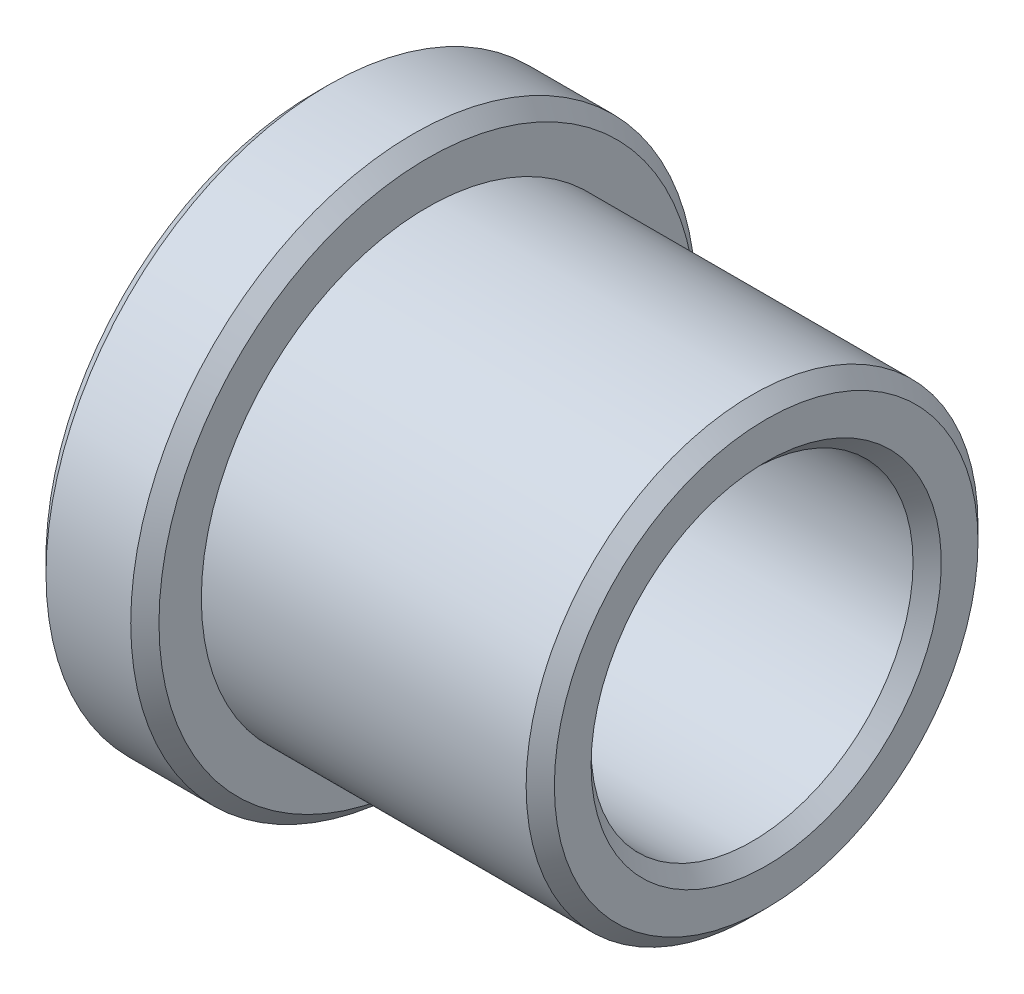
ISO-10303-21;
HEADER;
FILE_DESCRIPTION(('STEP AP214'),'2;1');
FILE_NAME('part.step','',(''),(''),'','','');
FILE_SCHEMA(('AUTOMOTIVE_DESIGN { 1 0 10303 214 1 1 1 1 }'));
ENDSEC;
DATA;
#1=APPLICATION_CONTEXT('core data for automotive mechanical design processes');
#2=APPLICATION_PROTOCOL_DEFINITION('international standard','automotive_design',2000,#1);
#3=PRODUCT_CONTEXT('',#1,'mechanical');
#4=PRODUCT('Part','Part','',(#3));
#5=PRODUCT_RELATED_PRODUCT_CATEGORY('part','',(#4));
#6=PRODUCT_DEFINITION_FORMATION('','',#4);
#7=PRODUCT_DEFINITION_CONTEXT('part definition',#1,'design');
#8=PRODUCT_DEFINITION('design','',#6,#7);
#9=PRODUCT_DEFINITION_SHAPE('','',#8);
#10=(LENGTH_UNIT() NAMED_UNIT(*) SI_UNIT(.MILLI.,.METRE.));
#11=(NAMED_UNIT(*) PLANE_ANGLE_UNIT() SI_UNIT($,.RADIAN.));
#12=(NAMED_UNIT(*) SI_UNIT($,.STERADIAN.) SOLID_ANGLE_UNIT());
#13=UNCERTAINTY_MEASURE_WITH_UNIT(LENGTH_MEASURE(1.E-05),#10,'distance_accuracy_value','');
#14=(GEOMETRIC_REPRESENTATION_CONTEXT(3) GLOBAL_UNCERTAINTY_ASSIGNED_CONTEXT((#13)) GLOBAL_UNIT_ASSIGNED_CONTEXT((#10,
#11,#12)) REPRESENTATION_CONTEXT('',''));
#15=CARTESIAN_POINT('',(0.,0.,0.));
#16=DIRECTION('',(0.,0.,1.));
#17=DIRECTION('',(1.,0.,0.));
#18=AXIS2_PLACEMENT_3D('',#15,#16,#17);
#19=CARTESIAN_POINT('',(0.,5.,0.));
#20=DIRECTION('',(1.,0.,0.));
#21=DIRECTION('',(0.,0.,-1.));
#22=AXIS2_PLACEMENT_3D('',#19,#20,#21);
#23=PLANE('',#22);
#24=CARTESIAN_POINT('',(0.,0.,0.));
#25=DIRECTION('',(1.,0.,0.));
#26=DIRECTION('',(0.,0.,-1.));
#27=AXIS2_PLACEMENT_3D('',#24,#25,#26);
#28=CIRCLE('',#27,3.1);
#29=CARTESIAN_POINT('',(0.,0.,-3.1));
#30=VERTEX_POINT('',#29);
#31=EDGE_CURVE('E57',#30,#30,#28,.T.);
#32=ORIENTED_EDGE('',*,*,#31,.T.);
#33=EDGE_LOOP('',(#32));
#34=FACE_BOUND('',#33,.T.);
#35=CARTESIAN_POINT('',(0.,0.,0.));
#36=DIRECTION('',(1.,0.,0.));
#37=DIRECTION('',(0.,0.,-1.));
#38=AXIS2_PLACEMENT_3D('',#35,#36,#37);
#39=CIRCLE('',#38,4.74999999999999);
#40=CARTESIAN_POINT('',(0.,0.,-4.74999999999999));
#41=VERTEX_POINT('',#40);
#42=EDGE_CURVE('E60',#41,#41,#39,.F.);
#43=ORIENTED_EDGE('',*,*,#42,.T.);
#44=EDGE_LOOP('',(#43));
#45=FACE_BOUND('',#44,.T.);
#46=ADVANCED_FACE('F31',(#34,#45),#23,.F.);
#47=CARTESIAN_POINT('',(0.,0.,0.));
#48=DIRECTION('',(-1.,0.,0.));
#49=DIRECTION('',(0.,0.,1.));
#50=AXIS2_PLACEMENT_3D('',#47,#48,#49);
#51=CYLINDRICAL_SURFACE('',#50,2.85);
#52=CARTESIAN_POINT('',(0.250000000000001,0.,0.));
#53=DIRECTION('',(1.,0.,0.));
#54=DIRECTION('',(0.,0.,-1.));
#55=AXIS2_PLACEMENT_3D('',#52,#53,#54);
#56=CIRCLE('',#55,2.85);
#57=CARTESIAN_POINT('',(0.250000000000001,0.,-2.85));
#58=VERTEX_POINT('',#57);
#59=EDGE_CURVE('E63',#58,#58,#56,.F.);
#60=ORIENTED_EDGE('',*,*,#59,.T.);
#61=EDGE_LOOP('',(#60));
#62=FACE_BOUND('',#61,.T.);
#63=CARTESIAN_POINT('',(7.75,0.,0.));
#64=DIRECTION('',(-1.,0.,0.));
#65=DIRECTION('',(0.,0.,1.));
#66=AXIS2_PLACEMENT_3D('',#63,#64,#65);
#67=CIRCLE('',#66,2.85);
#68=CARTESIAN_POINT('',(7.75,0.,2.85));
#69=VERTEX_POINT('',#68);
#70=EDGE_CURVE('E66',#69,#69,#67,.F.);
#71=ORIENTED_EDGE('',*,*,#70,.T.);
#72=EDGE_LOOP('',(#71));
#73=FACE_BOUND('',#72,.T.);
#74=ADVANCED_FACE('F86',(#62,#73),#51,.F.);
#75=CARTESIAN_POINT('',(8.,2.85,0.));
#76=DIRECTION('',(-1.,0.,0.));
#77=DIRECTION('',(0.,0.,1.));
#78=AXIS2_PLACEMENT_3D('',#75,#76,#77);
#79=PLANE('',#78);
#80=CARTESIAN_POINT('',(8.,0.,0.));
#81=DIRECTION('',(-1.,0.,0.));
#82=DIRECTION('',(0.,0.,1.));
#83=AXIS2_PLACEMENT_3D('',#80,#81,#82);
#84=CIRCLE('',#83,3.1);
#85=CARTESIAN_POINT('',(8.,0.,3.1));
#86=VERTEX_POINT('',#85);
#87=EDGE_CURVE('E51',#86,#86,#84,.T.);
#88=ORIENTED_EDGE('',*,*,#87,.T.);
#89=EDGE_LOOP('',(#88));
#90=FACE_BOUND('',#89,.T.);
#91=CARTESIAN_POINT('',(8.,0.,0.));
#92=DIRECTION('',(-1.,0.,0.));
#93=DIRECTION('',(0.,0.,1.));
#94=AXIS2_PLACEMENT_3D('',#91,#92,#93);
#95=CIRCLE('',#94,3.75);
#96=CARTESIAN_POINT('',(8.,0.,3.75));
#97=VERTEX_POINT('',#96);
#98=EDGE_CURVE('E54',#97,#97,#95,.F.);
#99=ORIENTED_EDGE('',*,*,#98,.T.);
#100=EDGE_LOOP('',(#99));
#101=FACE_BOUND('',#100,.T.);
#102=ADVANCED_FACE('F77',(#90,#101),#79,.F.);
#103=CARTESIAN_POINT('',(0.,0.,0.));
#104=DIRECTION('',(-1.,0.,0.));
#105=DIRECTION('',(0.,0.,1.));
#106=AXIS2_PLACEMENT_3D('',#103,#104,#105);
#107=CYLINDRICAL_SURFACE('',#106,4.);
#108=CARTESIAN_POINT('',(7.75,0.,0.));
#109=DIRECTION('',(-1.,0.,0.));
#110=DIRECTION('',(0.,0.,1.));
#111=AXIS2_PLACEMENT_3D('',#108,#109,#110);
#112=CIRCLE('',#111,4.);
#113=CARTESIAN_POINT('',(7.75,0.,4.));
#114=VERTEX_POINT('',#113);
#115=EDGE_CURVE('E46',#114,#114,#112,.T.);
#116=ORIENTED_EDGE('',*,*,#115,.T.);
#117=EDGE_LOOP('',(#116));
#118=FACE_BOUND('',#117,.T.);
#119=CARTESIAN_POINT('',(2.,0.,0.));
#120=DIRECTION('',(-1.,0.,0.));
#121=DIRECTION('',(0.,0.,1.));
#122=AXIS2_PLACEMENT_3D('',#119,#120,#121);
#123=CIRCLE('',#122,4.);
#124=CARTESIAN_POINT('',(2.,0.,4.));
#125=VERTEX_POINT('',#124);
#126=EDGE_CURVE('E69',#125,#125,#123,.T.);
#127=ORIENTED_EDGE('',*,*,#126,.F.);
#128=EDGE_LOOP('',(#127));
#129=FACE_BOUND('',#128,.T.);
#130=ADVANCED_FACE('F75',(#118,#129),#107,.T.);
#131=CARTESIAN_POINT('',(2.,4.,0.));
#132=DIRECTION('',(-1.,0.,0.));
#133=DIRECTION('',(0.,0.,1.));
#134=AXIS2_PLACEMENT_3D('',#131,#132,#133);
#135=PLANE('',#134);
#136=CARTESIAN_POINT('',(2.,0.,0.));
#137=DIRECTION('',(-1.,0.,0.));
#138=DIRECTION('',(0.,0.,1.));
#139=AXIS2_PLACEMENT_3D('',#136,#137,#138);
#140=CIRCLE('',#139,4.75);
#141=CARTESIAN_POINT('',(2.,0.,4.75));
#142=VERTEX_POINT('',#141);
#143=EDGE_CURVE('E10',#142,#142,#140,.F.);
#144=ORIENTED_EDGE('',*,*,#143,.T.);
#145=EDGE_LOOP('',(#144));
#146=FACE_BOUND('',#145,.T.);
#147=ORIENTED_EDGE('',*,*,#126,.T.);
#148=EDGE_LOOP('',(#147));
#149=FACE_BOUND('',#148,.T.);
#150=ADVANCED_FACE('F73',(#146,#149),#135,.F.);
#151=CARTESIAN_POINT('',(0.,0.,0.));
#152=DIRECTION('',(-1.,0.,0.));
#153=DIRECTION('',(0.,0.,1.));
#154=AXIS2_PLACEMENT_3D('',#151,#152,#153);
#155=CYLINDRICAL_SURFACE('',#154,5.);
#156=CARTESIAN_POINT('',(0.25000000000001,0.,0.));
#157=DIRECTION('',(1.,0.,0.));
#158=DIRECTION('',(0.,0.,-1.));
#159=AXIS2_PLACEMENT_3D('',#156,#157,#158);
#160=CIRCLE('',#159,5.);
#161=CARTESIAN_POINT('',(0.25000000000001,0.,-5.));
#162=VERTEX_POINT('',#161);
#163=EDGE_CURVE('E38',#162,#162,#160,.T.);
#164=ORIENTED_EDGE('',*,*,#163,.T.);
#165=EDGE_LOOP('',(#164));
#166=FACE_BOUND('',#165,.T.);
#167=CARTESIAN_POINT('',(1.75,0.,0.));
#168=DIRECTION('',(-1.,0.,0.));
#169=DIRECTION('',(0.,0.,1.));
#170=AXIS2_PLACEMENT_3D('',#167,#168,#169);
#171=CIRCLE('',#170,5.);
#172=CARTESIAN_POINT('',(1.75,0.,5.));
#173=VERTEX_POINT('',#172);
#174=EDGE_CURVE('E42',#173,#173,#171,.T.);
#175=ORIENTED_EDGE('',*,*,#174,.T.);
#176=EDGE_LOOP('',(#175));
#177=FACE_BOUND('',#176,.T.);
#178=ADVANCED_FACE('F84',(#166,#177),#155,.T.);
#179=CARTESIAN_POINT('',(0.250000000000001,0.,0.));
#180=DIRECTION('',(-1.,0.,0.));
#181=DIRECTION('',(0.,0.,1.));
#182=AXIS2_PLACEMENT_3D('',#179,#180,#181);
#183=CONICAL_SURFACE('',#182,2.85,0.78539816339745);
#184=ORIENTED_EDGE('',*,*,#31,.F.);
#185=EDGE_LOOP('',(#184));
#186=FACE_BOUND('',#185,.T.);
#187=ORIENTED_EDGE('',*,*,#59,.F.);
#188=EDGE_LOOP('',(#187));
#189=FACE_BOUND('',#188,.T.);
#190=ADVANCED_FACE('F99',(#186,#189),#183,.F.);
#191=CARTESIAN_POINT('',(8.,0.,0.));
#192=DIRECTION('',(1.,0.,0.));
#193=DIRECTION('',(0.,0.,-1.));
#194=AXIS2_PLACEMENT_3D('',#191,#192,#193);
#195=CONICAL_SURFACE('',#194,3.1,0.785398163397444);
#196=ORIENTED_EDGE('',*,*,#70,.F.);
#197=EDGE_LOOP('',(#196));
#198=FACE_BOUND('',#197,.T.);
#199=ORIENTED_EDGE('',*,*,#87,.F.);
#200=EDGE_LOOP('',(#199));
#201=FACE_BOUND('',#200,.T.);
#202=ADVANCED_FACE('F102',(#198,#201),#195,.F.);
#203=CARTESIAN_POINT('',(7.75,0.,0.));
#204=DIRECTION('',(-1.,0.,0.));
#205=DIRECTION('',(0.,0.,1.));
#206=AXIS2_PLACEMENT_3D('',#203,#204,#205);
#207=CONICAL_SURFACE('',#206,4.,0.785398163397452);
#208=ORIENTED_EDGE('',*,*,#98,.F.);
#209=EDGE_LOOP('',(#208));
#210=FACE_BOUND('',#209,.T.);
#211=ORIENTED_EDGE('',*,*,#115,.F.);
#212=EDGE_LOOP('',(#211));
#213=FACE_BOUND('',#212,.T.);
#214=ADVANCED_FACE('F106',(#210,#213),#207,.T.);
#215=CARTESIAN_POINT('',(0.,0.,0.));
#216=DIRECTION('',(1.,0.,0.));
#217=DIRECTION('',(0.,0.,-1.));
#218=AXIS2_PLACEMENT_3D('',#215,#216,#217);
#219=CONICAL_SURFACE('',#218,4.74999999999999,0.785398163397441);
#220=CARTESIAN_POINT('',(0.25000000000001,0.,-5.));
#221=CARTESIAN_POINT('',(0.247395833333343,0.,-4.99739583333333));
#222=CARTESIAN_POINT('',(0.244791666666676,0.,-4.99479166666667));
#223=CARTESIAN_POINT('',(0.239583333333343,0.,-4.98958333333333));
#224=CARTESIAN_POINT('',(0.236979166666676,0.,-4.98697916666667));
#225=CARTESIAN_POINT('',(0.231770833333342,0.,-4.98177083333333));
#226=CARTESIAN_POINT('',(0.229166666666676,0.,-4.97916666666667));
#227=CARTESIAN_POINT('',(0.223958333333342,0.,-4.97395833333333));
#228=CARTESIAN_POINT('',(0.221354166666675,0.,-4.97135416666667));
#229=CARTESIAN_POINT('',(0.216145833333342,0.,-4.96614583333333));
#230=CARTESIAN_POINT('',(0.213541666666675,0.,-4.96354166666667));
#231=CARTESIAN_POINT('',(0.208333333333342,0.,-4.95833333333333));
#232=CARTESIAN_POINT('',(0.205729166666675,0.,-4.95572916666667));
#233=CARTESIAN_POINT('',(0.200520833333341,0.,-4.95052083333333));
#234=CARTESIAN_POINT('',(0.197916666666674,0.,-4.94791666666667));
#235=CARTESIAN_POINT('',(0.192708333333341,0.,-4.94270833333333));
#236=CARTESIAN_POINT('',(0.190104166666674,0.,-4.94010416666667));
#237=CARTESIAN_POINT('',(0.184895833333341,0.,-4.93489583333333));
#238=CARTESIAN_POINT('',(0.182291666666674,0.,-4.93229166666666));
#239=CARTESIAN_POINT('',(0.17708333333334,0.,-4.92708333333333));
#240=CARTESIAN_POINT('',(0.174479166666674,0.,-4.92447916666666));
#241=CARTESIAN_POINT('',(0.16927083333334,0.,-4.91927083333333));
#242=CARTESIAN_POINT('',(0.166666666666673,0.,-4.91666666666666));
#243=CARTESIAN_POINT('',(0.16145833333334,0.,-4.91145833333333));
#244=CARTESIAN_POINT('',(0.158854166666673,0.,-4.90885416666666));
#245=CARTESIAN_POINT('',(0.153645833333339,0.,-4.90364583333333));
#246=CARTESIAN_POINT('',(0.151041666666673,0.,-4.90104166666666));
#247=CARTESIAN_POINT('',(0.145833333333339,0.,-4.89583333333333));
#248=CARTESIAN_POINT('',(0.143229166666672,0.,-4.89322916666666));
#249=CARTESIAN_POINT('',(0.138020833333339,0.,-4.88802083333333));
#250=CARTESIAN_POINT('',(0.135416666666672,0.,-4.88541666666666));
#251=CARTESIAN_POINT('',(0.130208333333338,0.,-4.88020833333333));
#252=CARTESIAN_POINT('',(0.127604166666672,0.,-4.87760416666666));
#253=CARTESIAN_POINT('',(0.122395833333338,0.,-4.87239583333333));
#254=CARTESIAN_POINT('',(0.119791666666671,0.,-4.86979166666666));
#255=CARTESIAN_POINT('',(0.114583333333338,0.,-4.86458333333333));
#256=CARTESIAN_POINT('',(0.111979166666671,0.,-4.86197916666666));
#257=CARTESIAN_POINT('',(0.106770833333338,0.,-4.85677083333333));
#258=CARTESIAN_POINT('',(0.104166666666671,0.,-4.85416666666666));
#259=CARTESIAN_POINT('',(0.0989583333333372,0.,-4.84895833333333));
#260=CARTESIAN_POINT('',(0.0963541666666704,0.,-4.84635416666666));
#261=CARTESIAN_POINT('',(0.0911458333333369,0.,-4.84114583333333));
#262=CARTESIAN_POINT('',(0.0885416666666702,0.,-4.83854166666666));
#263=CARTESIAN_POINT('',(0.0833333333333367,0.,-4.83333333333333));
#264=CARTESIAN_POINT('',(0.0807291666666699,0.,-4.83072916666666));
#265=CARTESIAN_POINT('',(0.0755208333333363,0.,-4.82552083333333));
#266=CARTESIAN_POINT('',(0.0729166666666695,0.,-4.82291666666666));
#267=CARTESIAN_POINT('',(0.067708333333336,0.,-4.81770833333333));
#268=CARTESIAN_POINT('',(0.0651041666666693,0.,-4.81510416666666));
#269=CARTESIAN_POINT('',(0.0598958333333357,0.,-4.80989583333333));
#270=CARTESIAN_POINT('',(0.0572916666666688,0.,-4.80729166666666));
#271=CARTESIAN_POINT('',(0.0520833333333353,0.,-4.80208333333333));
#272=CARTESIAN_POINT('',(0.0494791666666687,0.,-4.79947916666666));
#273=CARTESIAN_POINT('',(0.0442708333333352,0.,-4.79427083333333));
#274=CARTESIAN_POINT('',(0.0416666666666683,0.,-4.79166666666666));
#275=CARTESIAN_POINT('',(0.0364583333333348,0.,-4.78645833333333));
#276=CARTESIAN_POINT('',(0.033854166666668,0.,-4.78385416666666));
#277=CARTESIAN_POINT('',(0.0286458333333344,0.,-4.77864583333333));
#278=CARTESIAN_POINT('',(0.0260416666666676,0.,-4.77604166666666));
#279=CARTESIAN_POINT('',(0.0208333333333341,0.,-4.77083333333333));
#280=CARTESIAN_POINT('',(0.0182291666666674,0.,-4.76822916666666));
#281=CARTESIAN_POINT('',(0.0130208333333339,0.,-4.76302083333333));
#282=CARTESIAN_POINT('',(0.0104166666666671,0.,-4.76041666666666));
#283=CARTESIAN_POINT('',(0.00520833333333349,0.,-4.75520833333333));
#284=CARTESIAN_POINT('',(0.00260416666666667,0.,-4.75260416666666));
#285=CARTESIAN_POINT('',(0.,0.,-4.74999999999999));
#286=B_SPLINE_CURVE_WITH_KNOTS('',3,(#220,#221,#222,#223,#224,#225,#226,#227,#228,#229,#230,
#231,#232,#233,#234,#235,#236,#237,#238,#239,#240,#241,#242,#243,#244,#245,#246,#247,#248,#249,
#250,#251,#252,#253,#254,#255,#256,#257,#258,#259,#260,#261,#262,#263,#264,#265,#266,#267,#268,
#269,#270,#271,#272,#273,#274,#275,#276,#277,#278,#279,#280,#281,#282,#283,#284,#285),
.UNSPECIFIED.,.F.,.F.,(4,2,2,2,2,2,2,2,2,2,2,2,2,2,2,2,2,2,2,2,2,2,2,2,2,2,2,2,2,2,2,2,4),(0.,
0.01104854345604,0.02209708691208,0.0331456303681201,0.0441941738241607,0.0552427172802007,
0.0662912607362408,0.0773398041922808,0.0883883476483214,0.0994368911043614,0.110485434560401,
0.121533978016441,0.132582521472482,0.143631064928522,0.154679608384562,0.165728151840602,
0.176776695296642,0.187825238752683,0.198873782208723,0.209922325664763,0.220970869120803,
0.232019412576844,0.243067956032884,0.254116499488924,0.265165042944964,0.276213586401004,
0.287262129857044,0.298310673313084,0.309359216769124,0.320407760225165,0.331456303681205,
0.342504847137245,0.353553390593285),.UNSPECIFIED.);
#287=EDGE_CURVE('BSEAM109',#162,#41,#286,.T.);
#288=ORIENTED_EDGE('',*,*,#163,.F.);
#289=ORIENTED_EDGE('',*,*,#42,.F.);
#290=ORIENTED_EDGE('',*,*,#287,.T.);
#291=ORIENTED_EDGE('',*,*,#287,.F.);
#292=EDGE_LOOP('',(#288,#290,#289,#291));
#293=FACE_BOUND('',#292,.T.);
#294=ADVANCED_FACE('F109',(#293),#219,.T.);
#295=CARTESIAN_POINT('',(1.75,0.,0.));
#296=DIRECTION('',(-1.,0.,0.));
#297=DIRECTION('',(0.,0.,1.));
#298=AXIS2_PLACEMENT_3D('',#295,#296,#297);
#299=CONICAL_SURFACE('',#298,5.,0.78539816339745);
#300=ORIENTED_EDGE('',*,*,#143,.F.);
#301=EDGE_LOOP('',(#300));
#302=FACE_BOUND('',#301,.T.);
#303=ORIENTED_EDGE('',*,*,#174,.F.);
#304=EDGE_LOOP('',(#303));
#305=FACE_BOUND('',#304,.T.);
#306=ADVANCED_FACE('F33',(#302,#305),#299,.T.);
#307=CLOSED_SHELL('',(#46,#74,#102,#130,#150,#178,#190,#202,#214,#294,#306));
#308=MANIFOLD_SOLID_BREP('B2',#307);
#309=ADVANCED_BREP_SHAPE_REPRESENTATION('',(#18,#308),#14);
#310=SHAPE_DEFINITION_REPRESENTATION(#9,#309);
ENDSEC;
END-ISO-10303-21;
